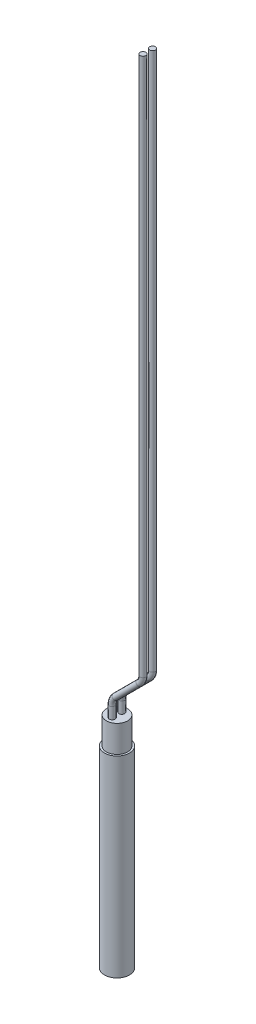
ISO-10303-21;
HEADER;
FILE_DESCRIPTION(('STEP AP214'),'2;1');
FILE_NAME('part.step','',(''),(''),'','','');
FILE_SCHEMA(('AUTOMOTIVE_DESIGN { 1 0 10303 214 1 1 1 1 }'));
ENDSEC;
DATA;
#1=APPLICATION_CONTEXT('core data for automotive mechanical design processes');
#2=APPLICATION_PROTOCOL_DEFINITION('international standard','automotive_design',2000,#1);
#3=PRODUCT_CONTEXT('',#1,'mechanical');
#4=PRODUCT('Part','Part','',(#3));
#5=PRODUCT_RELATED_PRODUCT_CATEGORY('part','',(#4));
#6=PRODUCT_DEFINITION_FORMATION('','',#4);
#7=PRODUCT_DEFINITION_CONTEXT('part definition',#1,'design');
#8=PRODUCT_DEFINITION('design','',#6,#7);
#9=PRODUCT_DEFINITION_SHAPE('','',#8);
#10=(LENGTH_UNIT() NAMED_UNIT(*) SI_UNIT(.MILLI.,.METRE.));
#11=(NAMED_UNIT(*) PLANE_ANGLE_UNIT() SI_UNIT($,.RADIAN.));
#12=(NAMED_UNIT(*) SI_UNIT($,.STERADIAN.) SOLID_ANGLE_UNIT());
#13=UNCERTAINTY_MEASURE_WITH_UNIT(LENGTH_MEASURE(1.E-05),#10,'distance_accuracy_value','');
#14=(GEOMETRIC_REPRESENTATION_CONTEXT(3) GLOBAL_UNCERTAINTY_ASSIGNED_CONTEXT((#13)) GLOBAL_UNIT_ASSIGNED_CONTEXT((#10,
#11,#12)) REPRESENTATION_CONTEXT('',''));
#15=CARTESIAN_POINT('',(0.,0.,0.));
#16=DIRECTION('',(0.,0.,1.));
#17=DIRECTION('',(1.,0.,0.));
#18=AXIS2_PLACEMENT_3D('',#15,#16,#17);
#19=CARTESIAN_POINT('',(8.,70.4852813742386,1.25));
#20=DIRECTION('',(0.,1.,0.));
#21=DIRECTION('',(-0.999999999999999,0.,0.));
#22=AXIS2_PLACEMENT_3D('',#19,#20,#21);
#23=CYLINDRICAL_SURFACE('',#22,0.75);
#24=CARTESIAN_POINT('',(8.,70.4852813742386,1.25));
#25=DIRECTION('',(0.,1.,0.));
#26=DIRECTION('',(0.,0.,0.999999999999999));
#27=AXIS2_PLACEMENT_3D('',#24,#25,#26);
#28=CIRCLE('',#27,0.75);
#29=CARTESIAN_POINT('',(8.75,70.4852813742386,1.24999999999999));
#30=VERTEX_POINT('',#29);
#31=EDGE_CURVE('E49',#30,#30,#28,.T.);
#32=ORIENTED_EDGE('',*,*,#31,.T.);
#33=EDGE_LOOP('',(#32));
#34=FACE_BOUND('',#33,.T.);
#35=CARTESIAN_POINT('',(8.,210.485281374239,1.25));
#36=DIRECTION('',(0.,1.,0.));
#37=DIRECTION('',(0.,0.,0.999999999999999));
#38=AXIS2_PLACEMENT_3D('',#35,#36,#37);
#39=CIRCLE('',#38,0.75);
#40=CARTESIAN_POINT('',(8.,210.485281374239,1.99999999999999));
#41=VERTEX_POINT('',#40);
#42=EDGE_CURVE('E11',#41,#41,#39,.T.);
#43=ORIENTED_EDGE('',*,*,#42,.F.);
#44=EDGE_LOOP('',(#43));
#45=FACE_BOUND('',#44,.T.);
#46=ADVANCED_FACE('F43',(#34,#45),#23,.T.);
#47=CARTESIAN_POINT('',(5.,70.4852813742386,1.25));
#48=DIRECTION('',(0.,0.,0.999999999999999));
#49=DIRECTION('',(0.999999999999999,0.,0.));
#50=AXIS2_PLACEMENT_3D('',#47,#48,#49);
#51=TOROIDAL_SURFACE('',#50,3.,0.75);
#52=CARTESIAN_POINT('',(7.12132034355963,68.3639610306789,1.25));
#53=DIRECTION('',(0.707106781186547,0.707106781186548,0.));
#54=DIRECTION('',(0.,0.,0.999999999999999));
#55=AXIS2_PLACEMENT_3D('',#52,#53,#54);
#56=CIRCLE('',#55,0.75);
#57=CARTESIAN_POINT('',(7.65165042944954,67.833630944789,1.25));
#58=VERTEX_POINT('',#57);
#59=EDGE_CURVE('E53',#58,#58,#56,.T.);
#60=CARTESIAN_POINT('',(5.,70.4852813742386,1.25));
#61=DIRECTION('',(0.,0.,0.999999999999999));
#62=DIRECTION('',(0.999999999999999,0.,0.));
#63=AXIS2_PLACEMENT_3D('',#60,#61,#62);
#64=CIRCLE('',#63,3.75);
#65=EDGE_CURVE('',#58,#30,#64,.T.);
#66=ORIENTED_EDGE('',*,*,#59,.T.);
#67=ORIENTED_EDGE('',*,*,#31,.F.);
#68=ORIENTED_EDGE('',*,*,#65,.T.);
#69=ORIENTED_EDGE('',*,*,#65,.F.);
#70=EDGE_LOOP('',(#66,#68,#67,#69));
#71=FACE_BOUND('',#70,.T.);
#72=ADVANCED_FACE('F87',(#71),#51,.T.);
#73=CARTESIAN_POINT('',(0.878679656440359,62.1213203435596,1.25));
#74=DIRECTION('',(0.707106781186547,0.707106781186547,0.));
#75=DIRECTION('',(-0.707106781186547,0.707106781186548,0.));
#76=AXIS2_PLACEMENT_3D('',#73,#74,#75);
#77=CYLINDRICAL_SURFACE('',#76,0.75);
#78=CARTESIAN_POINT('',(0.878679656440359,62.1213203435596,1.25));
#79=DIRECTION('',(0.707106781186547,0.707106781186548,0.));
#80=DIRECTION('',(0.,0.,0.999999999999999));
#81=AXIS2_PLACEMENT_3D('',#78,#79,#80);
#82=CIRCLE('',#81,0.75);
#83=CARTESIAN_POINT('',(0.348349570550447,62.6516504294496,1.25));
#84=VERTEX_POINT('',#83);
#85=EDGE_CURVE('E57',#84,#84,#82,.T.);
#86=ORIENTED_EDGE('',*,*,#85,.T.);
#87=EDGE_LOOP('',(#86));
#88=FACE_BOUND('',#87,.T.);
#89=ORIENTED_EDGE('',*,*,#59,.F.);
#90=EDGE_LOOP('',(#89));
#91=FACE_BOUND('',#90,.T.);
#92=ADVANCED_FACE('F91',(#88,#91),#77,.T.);
#93=CARTESIAN_POINT('',(3.,60.,1.25));
#94=DIRECTION('',(0.,0.,-0.999999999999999));
#95=DIRECTION('',(-0.999999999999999,0.,0.));
#96=AXIS2_PLACEMENT_3D('',#93,#94,#95);
#97=TOROIDAL_SURFACE('',#96,3.,0.75);
#98=CARTESIAN_POINT('',(0.,60.,1.24999999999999));
#99=DIRECTION('',(0.,1.,0.));
#100=DIRECTION('',(0.,0.,0.999999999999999));
#101=AXIS2_PLACEMENT_3D('',#98,#99,#100);
#102=CIRCLE('',#101,0.75);
#103=CARTESIAN_POINT('',(-0.750000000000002,60.,1.24999999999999));
#104=VERTEX_POINT('',#103);
#105=EDGE_CURVE('E62',#104,#104,#102,.T.);
#106=CARTESIAN_POINT('',(3.,60.,1.25));
#107=DIRECTION('',(0.,0.,-0.999999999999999));
#108=DIRECTION('',(-0.999999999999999,0.,0.));
#109=AXIS2_PLACEMENT_3D('',#106,#107,#108);
#110=CIRCLE('',#109,3.75);
#111=EDGE_CURVE('',#104,#84,#110,.T.);
#112=ORIENTED_EDGE('',*,*,#105,.T.);
#113=ORIENTED_EDGE('',*,*,#85,.F.);
#114=ORIENTED_EDGE('',*,*,#111,.T.);
#115=ORIENTED_EDGE('',*,*,#111,.F.);
#116=EDGE_LOOP('',(#112,#114,#113,#115));
#117=FACE_BOUND('',#116,.T.);
#118=ADVANCED_FACE('F69',(#117),#97,.T.);
#119=CARTESIAN_POINT('',(0.,60.,1.24999999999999));
#120=DIRECTION('',(0.,-1.,0.));
#121=DIRECTION('',(0.,0.,-0.999999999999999));
#122=AXIS2_PLACEMENT_3D('',#119,#120,#121);
#123=CYLINDRICAL_SURFACE('',#122,0.75);
#124=ORIENTED_EDGE('',*,*,#105,.F.);
#125=EDGE_LOOP('',(#124));
#126=FACE_BOUND('',#125,.T.);
#127=CARTESIAN_POINT('',(0.,57.,1.24999999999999));
#128=DIRECTION('',(0.,1.,0.));
#129=DIRECTION('',(0.,0.,0.999999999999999));
#130=AXIS2_PLACEMENT_3D('',#127,#128,#129);
#131=CIRCLE('',#130,0.75);
#132=CARTESIAN_POINT('',(0.,57.,1.99999999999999));
#133=VERTEX_POINT('',#132);
#134=EDGE_CURVE('E63',#133,#133,#131,.T.);
#135=ORIENTED_EDGE('',*,*,#134,.T.);
#136=EDGE_LOOP('',(#135));
#137=FACE_BOUND('',#136,.T.);
#138=ADVANCED_FACE('F72',(#126,#137),#123,.T.);
#139=CARTESIAN_POINT('',(8.,210.485281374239,1.25));
#140=DIRECTION('',(0.,1.,0.));
#141=DIRECTION('',(0.,0.,0.999999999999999));
#142=AXIS2_PLACEMENT_3D('',#139,#140,#141);
#143=PLANE('',#142);
#144=ORIENTED_EDGE('',*,*,#42,.T.);
#145=EDGE_LOOP('',(#144));
#146=FACE_BOUND('',#145,.T.);
#147=ADVANCED_FACE('F75',(#146),#143,.T.);
#148=CARTESIAN_POINT('',(0.,57.,1.24999999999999));
#149=DIRECTION('',(0.,1.,0.));
#150=DIRECTION('',(0.,0.,0.999999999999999));
#151=AXIS2_PLACEMENT_3D('',#148,#149,#150);
#152=PLANE('',#151);
#153=ORIENTED_EDGE('',*,*,#134,.F.);
#154=EDGE_LOOP('',(#153));
#155=FACE_BOUND('',#154,.T.);
#156=ADVANCED_FACE('F79',(#155),#152,.F.);
#157=CLOSED_SHELL('',(#46,#72,#92,#118,#138,#147,#156));
#158=MANIFOLD_SOLID_BREP('B2',#157);
#159=CARTESIAN_POINT('',(7.99999999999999,70.4852813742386,-1.25));
#160=DIRECTION('',(0.,1.,0.));
#161=DIRECTION('',(-0.999999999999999,0.,0.));
#162=AXIS2_PLACEMENT_3D('',#159,#160,#161);
#163=CYLINDRICAL_SURFACE('',#162,0.75);
#164=CARTESIAN_POINT('',(7.99999999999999,70.4852813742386,-1.25));
#165=DIRECTION('',(0.,1.,0.));
#166=DIRECTION('',(0.,0.,0.999999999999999));
#167=AXIS2_PLACEMENT_3D('',#164,#165,#166);
#168=CIRCLE('',#167,0.75);
#169=CARTESIAN_POINT('',(8.75,70.4852813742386,-1.25));
#170=VERTEX_POINT('',#169);
#171=EDGE_CURVE('E142',#170,#170,#168,.T.);
#172=ORIENTED_EDGE('',*,*,#171,.T.);
#173=EDGE_LOOP('',(#172));
#174=FACE_BOUND('',#173,.T.);
#175=CARTESIAN_POINT('',(8.,210.485281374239,-1.25));
#176=DIRECTION('',(0.,1.,0.));
#177=DIRECTION('',(0.,0.,0.999999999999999));
#178=AXIS2_PLACEMENT_3D('',#175,#176,#177);
#179=CIRCLE('',#178,0.75);
#180=CARTESIAN_POINT('',(8.,210.485281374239,-0.500000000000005));
#181=VERTEX_POINT('',#180);
#182=EDGE_CURVE('E42',#181,#181,#179,.T.);
#183=ORIENTED_EDGE('',*,*,#182,.F.);
#184=EDGE_LOOP('',(#183));
#185=FACE_BOUND('',#184,.T.);
#186=ADVANCED_FACE('F136',(#174,#185),#163,.T.);
#187=CARTESIAN_POINT('',(5.,70.4852813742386,-1.25));
#188=DIRECTION('',(0.,0.,0.999999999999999));
#189=DIRECTION('',(0.999999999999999,0.,0.));
#190=AXIS2_PLACEMENT_3D('',#187,#188,#189);
#191=TOROIDAL_SURFACE('',#190,3.,0.75);
#192=CARTESIAN_POINT('',(7.12132034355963,68.3639610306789,-1.25));
#193=DIRECTION('',(0.707106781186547,0.707106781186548,0.));
#194=DIRECTION('',(0.,0.,0.999999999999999));
#195=AXIS2_PLACEMENT_3D('',#192,#193,#194);
#196=CIRCLE('',#195,0.75);
#197=CARTESIAN_POINT('',(7.65165042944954,67.833630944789,-1.25));
#198=VERTEX_POINT('',#197);
#199=EDGE_CURVE('E146',#198,#198,#196,.T.);
#200=CARTESIAN_POINT('',(5.,70.4852813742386,-1.25));
#201=DIRECTION('',(0.,0.,0.999999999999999));
#202=DIRECTION('',(0.999999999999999,0.,0.));
#203=AXIS2_PLACEMENT_3D('',#200,#201,#202);
#204=CIRCLE('',#203,3.75);
#205=EDGE_CURVE('',#198,#170,#204,.T.);
#206=ORIENTED_EDGE('',*,*,#199,.T.);
#207=ORIENTED_EDGE('',*,*,#171,.F.);
#208=ORIENTED_EDGE('',*,*,#205,.T.);
#209=ORIENTED_EDGE('',*,*,#205,.F.);
#210=EDGE_LOOP('',(#206,#208,#207,#209));
#211=FACE_BOUND('',#210,.T.);
#212=ADVANCED_FACE('F180',(#211),#191,.T.);
#213=CARTESIAN_POINT('',(0.878679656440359,62.1213203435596,-1.25));
#214=DIRECTION('',(0.707106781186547,0.707106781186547,0.));
#215=DIRECTION('',(-0.707106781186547,0.707106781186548,0.));
#216=AXIS2_PLACEMENT_3D('',#213,#214,#215);
#217=CYLINDRICAL_SURFACE('',#216,0.75);
#218=CARTESIAN_POINT('',(0.878679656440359,62.1213203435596,-1.25));
#219=DIRECTION('',(0.707106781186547,0.707106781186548,0.));
#220=DIRECTION('',(0.,0.,0.999999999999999));
#221=AXIS2_PLACEMENT_3D('',#218,#219,#220);
#222=CIRCLE('',#221,0.75);
#223=CARTESIAN_POINT('',(0.348349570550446,62.6516504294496,-1.25000000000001));
#224=VERTEX_POINT('',#223);
#225=EDGE_CURVE('E150',#224,#224,#222,.T.);
#226=ORIENTED_EDGE('',*,*,#225,.T.);
#227=EDGE_LOOP('',(#226));
#228=FACE_BOUND('',#227,.T.);
#229=ORIENTED_EDGE('',*,*,#199,.F.);
#230=EDGE_LOOP('',(#229));
#231=FACE_BOUND('',#230,.T.);
#232=ADVANCED_FACE('F184',(#228,#231),#217,.T.);
#233=CARTESIAN_POINT('',(3.,60.,-1.25));
#234=DIRECTION('',(0.,0.,-0.999999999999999));
#235=DIRECTION('',(-0.999999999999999,0.,0.));
#236=AXIS2_PLACEMENT_3D('',#233,#234,#235);
#237=TOROIDAL_SURFACE('',#236,3.,0.75);
#238=CARTESIAN_POINT('',(0.,60.,-1.25));
#239=DIRECTION('',(0.,1.,0.));
#240=DIRECTION('',(0.,0.,0.999999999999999));
#241=AXIS2_PLACEMENT_3D('',#238,#239,#240);
#242=CIRCLE('',#241,0.75);
#243=CARTESIAN_POINT('',(-0.750000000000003,60.,-1.25));
#244=VERTEX_POINT('',#243);
#245=EDGE_CURVE('E155',#244,#244,#242,.T.);
#246=CARTESIAN_POINT('',(3.,60.,-1.25));
#247=DIRECTION('',(0.,0.,-0.999999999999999));
#248=DIRECTION('',(-0.999999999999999,0.,0.));
#249=AXIS2_PLACEMENT_3D('',#246,#247,#248);
#250=CIRCLE('',#249,3.75);
#251=EDGE_CURVE('',#244,#224,#250,.T.);
#252=ORIENTED_EDGE('',*,*,#245,.T.);
#253=ORIENTED_EDGE('',*,*,#225,.F.);
#254=ORIENTED_EDGE('',*,*,#251,.T.);
#255=ORIENTED_EDGE('',*,*,#251,.F.);
#256=EDGE_LOOP('',(#252,#254,#253,#255));
#257=FACE_BOUND('',#256,.T.);
#258=ADVANCED_FACE('F162',(#257),#237,.T.);
#259=CARTESIAN_POINT('',(0.,60.,-1.25));
#260=DIRECTION('',(0.,-1.,0.));
#261=DIRECTION('',(0.,0.,-0.999999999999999));
#262=AXIS2_PLACEMENT_3D('',#259,#260,#261);
#263=CYLINDRICAL_SURFACE('',#262,0.75);
#264=ORIENTED_EDGE('',*,*,#245,.F.);
#265=EDGE_LOOP('',(#264));
#266=FACE_BOUND('',#265,.T.);
#267=CARTESIAN_POINT('',(0.,57.,-1.25));
#268=DIRECTION('',(0.,1.,0.));
#269=DIRECTION('',(0.,0.,0.999999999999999));
#270=AXIS2_PLACEMENT_3D('',#267,#268,#269);
#271=CIRCLE('',#270,0.75);
#272=CARTESIAN_POINT('',(0.,57.,-0.500000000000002));
#273=VERTEX_POINT('',#272);
#274=EDGE_CURVE('E156',#273,#273,#271,.T.);
#275=ORIENTED_EDGE('',*,*,#274,.T.);
#276=EDGE_LOOP('',(#275));
#277=FACE_BOUND('',#276,.T.);
#278=ADVANCED_FACE('F165',(#266,#277),#263,.T.);
#279=CARTESIAN_POINT('',(8.,210.485281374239,-1.25));
#280=DIRECTION('',(0.,1.,0.));
#281=DIRECTION('',(0.,0.,0.999999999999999));
#282=AXIS2_PLACEMENT_3D('',#279,#280,#281);
#283=PLANE('',#282);
#284=ORIENTED_EDGE('',*,*,#182,.T.);
#285=EDGE_LOOP('',(#284));
#286=FACE_BOUND('',#285,.T.);
#287=ADVANCED_FACE('F168',(#286),#283,.T.);
#288=CARTESIAN_POINT('',(0.,57.,-1.25));
#289=DIRECTION('',(0.,1.,0.));
#290=DIRECTION('',(0.,0.,0.999999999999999));
#291=AXIS2_PLACEMENT_3D('',#288,#289,#290);
#292=PLANE('',#291);
#293=ORIENTED_EDGE('',*,*,#274,.F.);
#294=EDGE_LOOP('',(#293));
#295=FACE_BOUND('',#294,.T.);
#296=ADVANCED_FACE('F172',(#295),#292,.F.);
#297=CLOSED_SHELL('',(#186,#212,#232,#258,#278,#287,#296));
#298=MANIFOLD_SOLID_BREP('B6',#297);
#299=CARTESIAN_POINT('',(0.,92.1473863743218,0.));
#300=DIRECTION('',(0.,1.,0.));
#301=DIRECTION('',(0.,0.,0.999999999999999));
#302=AXIS2_PLACEMENT_3D('',#299,#300,#301);
#303=CYLINDRICAL_SURFACE('',#302,3.25000000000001);
#304=CARTESIAN_POINT('',(0.,50.,0.));
#305=DIRECTION('',(0.,1.,0.));
#306=DIRECTION('',(0.,0.,0.999999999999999));
#307=AXIS2_PLACEMENT_3D('',#304,#305,#306);
#308=CIRCLE('',#307,3.25);
#309=CARTESIAN_POINT('',(0.,50.,3.25));
#310=VERTEX_POINT('',#309);
#311=EDGE_CURVE('E135',#310,#310,#308,.T.);
#312=ORIENTED_EDGE('',*,*,#311,.F.);
#313=EDGE_LOOP('',(#312));
#314=FACE_BOUND('',#313,.T.);
#315=CARTESIAN_POINT('',(0.,0.,0.));
#316=DIRECTION('',(0.,1.,0.));
#317=DIRECTION('',(0.,0.,0.999999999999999));
#318=AXIS2_PLACEMENT_3D('',#315,#316,#317);
#319=CIRCLE('',#318,3.25000000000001);
#320=CARTESIAN_POINT('',(0.,0.,3.25));
#321=VERTEX_POINT('',#320);
#322=EDGE_CURVE('E236',#321,#321,#319,.T.);
#323=ORIENTED_EDGE('',*,*,#322,.T.);
#324=EDGE_LOOP('',(#323));
#325=FACE_BOUND('',#324,.T.);
#326=ADVANCED_FACE('F222',(#314,#325),#303,.T.);
#327=CARTESIAN_POINT('',(2.75,50.,0.));
#328=DIRECTION('',(0.,-1.,0.));
#329=DIRECTION('',(0.,0.,-0.999999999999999));
#330=AXIS2_PLACEMENT_3D('',#327,#328,#329);
#331=PLANE('',#330);
#332=CARTESIAN_POINT('',(0.,50.,0.));
#333=DIRECTION('',(0.,1.,0.));
#334=DIRECTION('',(0.,0.,0.999999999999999));
#335=AXIS2_PLACEMENT_3D('',#332,#333,#334);
#336=CIRCLE('',#335,2.75);
#337=CARTESIAN_POINT('',(0.,50.,2.75));
#338=VERTEX_POINT('',#337);
#339=EDGE_CURVE('E228',#338,#338,#336,.T.);
#340=ORIENTED_EDGE('',*,*,#339,.F.);
#341=EDGE_LOOP('',(#340));
#342=FACE_BOUND('',#341,.T.);
#343=ORIENTED_EDGE('',*,*,#311,.T.);
#344=EDGE_LOOP('',(#343));
#345=FACE_BOUND('',#344,.T.);
#346=ADVANCED_FACE('F254',(#342,#345),#331,.F.);
#347=CARTESIAN_POINT('',(0.,92.1473863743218,0.));
#348=DIRECTION('',(0.,1.,0.));
#349=DIRECTION('',(0.,0.,0.999999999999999));
#350=AXIS2_PLACEMENT_3D('',#347,#348,#349);
#351=CYLINDRICAL_SURFACE('',#350,2.75);
#352=CARTESIAN_POINT('',(0.,57.,0.));
#353=DIRECTION('',(0.,1.,0.));
#354=DIRECTION('',(0.,0.,0.999999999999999));
#355=AXIS2_PLACEMENT_3D('',#352,#353,#354);
#356=CIRCLE('',#355,2.75);
#357=CARTESIAN_POINT('',(0.,57.,2.75));
#358=VERTEX_POINT('',#357);
#359=EDGE_CURVE('E232',#358,#358,#356,.T.);
#360=ORIENTED_EDGE('',*,*,#359,.F.);
#361=EDGE_LOOP('',(#360));
#362=FACE_BOUND('',#361,.T.);
#363=ORIENTED_EDGE('',*,*,#339,.T.);
#364=EDGE_LOOP('',(#363));
#365=FACE_BOUND('',#364,.T.);
#366=ADVANCED_FACE('F250',(#362,#365),#351,.T.);
#367=CARTESIAN_POINT('',(2.75,57.,0.));
#368=DIRECTION('',(0.,-1.,0.));
#369=DIRECTION('',(0.,0.,-0.999999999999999));
#370=AXIS2_PLACEMENT_3D('',#367,#368,#369);
#371=PLANE('',#370);
#372=ORIENTED_EDGE('',*,*,#359,.T.);
#373=EDGE_LOOP('',(#372));
#374=FACE_BOUND('',#373,.T.);
#375=ADVANCED_FACE('F245',(#374),#371,.F.);
#376=CARTESIAN_POINT('',(0.,0.,0.));
#377=DIRECTION('',(0.,1.,0.));
#378=DIRECTION('',(0.,0.,0.999999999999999));
#379=AXIS2_PLACEMENT_3D('',#376,#377,#378);
#380=PLANE('',#379);
#381=ORIENTED_EDGE('',*,*,#322,.F.);
#382=EDGE_LOOP('',(#381));
#383=FACE_BOUND('',#382,.T.);
#384=ADVANCED_FACE('F243',(#383),#380,.F.);
#385=CLOSED_SHELL('',(#326,#346,#366,#375,#384));
#386=MANIFOLD_SOLID_BREP('B37',#385);
#387=ADVANCED_BREP_SHAPE_REPRESENTATION('',(#18,#158,#298,#386),#14);
#388=SHAPE_DEFINITION_REPRESENTATION(#9,#387);
ENDSEC;
END-ISO-10303-21;
